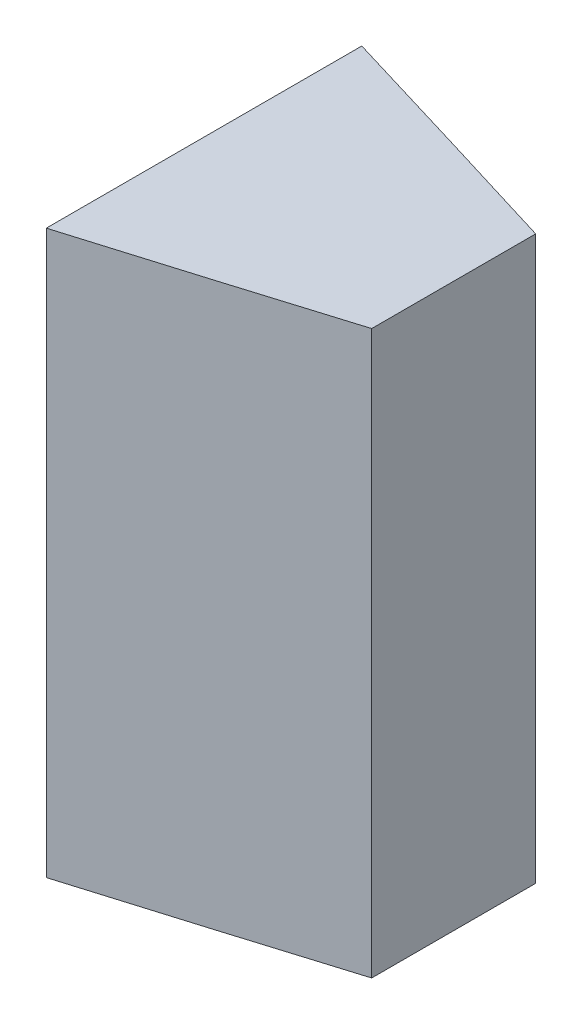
ISO-10303-21;
HEADER;
FILE_DESCRIPTION(('STEP AP214'),'2;1');
FILE_NAME('part.step','',(''),(''),'','','');
FILE_SCHEMA(('AUTOMOTIVE_DESIGN { 1 0 10303 214 1 1 1 1 }'));
ENDSEC;
DATA;
#1=APPLICATION_CONTEXT('core data for automotive mechanical design processes');
#2=APPLICATION_PROTOCOL_DEFINITION('international standard','automotive_design',2000,#1);
#3=PRODUCT_CONTEXT('',#1,'mechanical');
#4=PRODUCT('Part','Part','',(#3));
#5=PRODUCT_RELATED_PRODUCT_CATEGORY('part','',(#4));
#6=PRODUCT_DEFINITION_FORMATION('','',#4);
#7=PRODUCT_DEFINITION_CONTEXT('part definition',#1,'design');
#8=PRODUCT_DEFINITION('design','',#6,#7);
#9=PRODUCT_DEFINITION_SHAPE('','',#8);
#10=(LENGTH_UNIT() NAMED_UNIT(*) SI_UNIT(.MILLI.,.METRE.));
#11=(NAMED_UNIT(*) PLANE_ANGLE_UNIT() SI_UNIT($,.RADIAN.));
#12=(NAMED_UNIT(*) SI_UNIT($,.STERADIAN.) SOLID_ANGLE_UNIT());
#13=UNCERTAINTY_MEASURE_WITH_UNIT(LENGTH_MEASURE(1.E-05),#10,'distance_accuracy_value','');
#14=(GEOMETRIC_REPRESENTATION_CONTEXT(3) GLOBAL_UNCERTAINTY_ASSIGNED_CONTEXT((#13)) GLOBAL_UNIT_ASSIGNED_CONTEXT((#10,
#11,#12)) REPRESENTATION_CONTEXT('',''));
#15=CARTESIAN_POINT('',(0.,0.,0.));
#16=DIRECTION('',(0.,0.,1.));
#17=DIRECTION('',(1.,0.,0.));
#18=AXIS2_PLACEMENT_3D('',#15,#16,#17);
#19=CARTESIAN_POINT('',(35.0699557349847,9.10399609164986,-10.2042152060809));
#20=CARTESIAN_POINT('',(24.7263871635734,9.10399609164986,-13.389122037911));
#21=CARTESIAN_POINT('',(14.3682158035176,9.10399609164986,-16.5264355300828));
#22=CARTESIAN_POINT('',(4.00000000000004,9.10399609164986,-19.6301586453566));
#23=B_SPLINE_CURVE_WITH_KNOTS('',3,(#19,#20,#21,#22),.UNSPECIFIED.,.F.,.F.,(4,4),(0.,1.),.UNSPECIFIED.);
#24=DIRECTION('',(0.,1.,0.));
#25=VECTOR('',#24,1.);
#26=SURFACE_OF_LINEAR_EXTRUSION('',#23,#25);
#27=CARTESIAN_POINT('',(4.00000000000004,79.1039960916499,-19.6301586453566));
#28=CARTESIAN_POINT('',(14.3682158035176,79.1039960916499,-16.5264355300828));
#29=CARTESIAN_POINT('',(24.7263871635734,79.1039960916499,-13.389122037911));
#30=CARTESIAN_POINT('',(35.0699557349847,79.1039960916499,-10.2042152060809));
#31=B_SPLINE_CURVE_WITH_KNOTS('',3,(#27,#28,#29,#30),.UNSPECIFIED.,.F.,.F.,(4,4),(0.,1.),.UNSPECIFIED.);
#32=CARTESIAN_POINT('',(35.0699557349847,79.1039960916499,-10.2042152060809));
#33=VERTEX_POINT('',#32);
#34=CARTESIAN_POINT('',(4.00000000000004,79.1039960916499,-19.6301586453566));
#35=VERTEX_POINT('',#34);
#36=EDGE_CURVE('E146',#33,#35,#31,.F.);
#37=ORIENTED_EDGE('',*,*,#36,.F.);
#38=DIRECTION('',(0.,1.,0.));
#39=VECTOR('',#38,1.);
#40=CARTESIAN_POINT('',(35.0699557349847,9.10399609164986,-10.2042152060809));
#41=LINE('',#40,#39);
#42=CARTESIAN_POINT('',(35.0699557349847,9.10399609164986,-10.2042152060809));
#43=VERTEX_POINT('',#42);
#44=EDGE_CURVE('E11',#43,#33,#41,.T.);
#45=ORIENTED_EDGE('',*,*,#44,.F.);
#46=CARTESIAN_POINT('',(35.0699557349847,9.10399609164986,-10.2042152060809));
#47=CARTESIAN_POINT('',(24.7263871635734,9.10399609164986,-13.389122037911));
#48=CARTESIAN_POINT('',(14.3682158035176,9.10399609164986,-16.5264355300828));
#49=CARTESIAN_POINT('',(4.00000000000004,9.10399609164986,-19.6301586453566));
#50=B_SPLINE_CURVE_WITH_KNOTS('',3,(#46,#47,#48,#49),.UNSPECIFIED.,.F.,.F.,(4,4),(0.,1.),.UNSPECIFIED.);
#51=CARTESIAN_POINT('',(4.00000000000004,9.10399609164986,-19.6301586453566));
#52=VERTEX_POINT('',#51);
#53=EDGE_CURVE('E100',#43,#52,#50,.T.);
#54=ORIENTED_EDGE('',*,*,#53,.T.);
#55=DIRECTION('',(0.,1.,0.));
#56=VECTOR('',#55,1.);
#57=CARTESIAN_POINT('',(4.00000000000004,9.10399609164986,-19.6301586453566));
#58=LINE('',#57,#56);
#59=EDGE_CURVE('E79',#52,#35,#58,.T.);
#60=ORIENTED_EDGE('',*,*,#59,.T.);
#61=EDGE_LOOP('',(#37,#45,#54,#60));
#62=FACE_BOUND('',#61,.T.);
#63=ADVANCED_FACE('F33',(#62),#26,.T.);
#64=CARTESIAN_POINT('',(35.0699557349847,9.10399609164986,10.2042152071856));
#65=DIRECTION('',(1.,0.,0.));
#66=DIRECTION('',(0.,0.,-1.));
#67=AXIS2_PLACEMENT_3D('',#64,#65,#66);
#68=PLANE('',#67);
#69=DIRECTION('',(0.,0.,-1.));
#70=VECTOR('',#69,1.);
#71=CARTESIAN_POINT('',(35.0699557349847,79.1039960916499,10.2042152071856));
#72=LINE('',#71,#70);
#73=CARTESIAN_POINT('',(35.0699557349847,79.1039960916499,10.2042152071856));
#74=VERTEX_POINT('',#73);
#75=EDGE_CURVE('E102',#74,#33,#72,.T.);
#76=ORIENTED_EDGE('',*,*,#75,.F.);
#77=DIRECTION('',(0.,1.,0.));
#78=VECTOR('',#77,1.);
#79=CARTESIAN_POINT('',(35.0699557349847,9.10399609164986,10.2042152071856));
#80=LINE('',#79,#78);
#81=CARTESIAN_POINT('',(35.0699557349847,9.10399609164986,10.2042152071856));
#82=VERTEX_POINT('',#81);
#83=EDGE_CURVE('E45',#82,#74,#80,.T.);
#84=ORIENTED_EDGE('',*,*,#83,.F.);
#85=DIRECTION('',(0.,0.,-1.));
#86=VECTOR('',#85,1.);
#87=CARTESIAN_POINT('',(35.0699557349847,9.10399609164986,10.2042152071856));
#88=LINE('',#87,#86);
#89=EDGE_CURVE('E96',#82,#43,#88,.T.);
#90=ORIENTED_EDGE('',*,*,#89,.T.);
#91=ORIENTED_EDGE('',*,*,#44,.T.);
#92=EDGE_LOOP('',(#76,#84,#90,#91));
#93=FACE_BOUND('',#92,.T.);
#94=ADVANCED_FACE('F132',(#93),#68,.T.);
#95=CARTESIAN_POINT('',(4.00000000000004,9.10399609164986,19.630158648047));
#96=CARTESIAN_POINT('',(14.368216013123,9.10399609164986,16.5264354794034));
#97=CARTESIAN_POINT('',(24.7263869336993,9.10399609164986,13.3891221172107));
#98=CARTESIAN_POINT('',(35.0699557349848,9.10399609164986,10.2042152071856));
#99=B_SPLINE_CURVE_WITH_KNOTS('',3,(#95,#96,#97,#98),.UNSPECIFIED.,.F.,.F.,(4,4),(0.,1.),.UNSPECIFIED.);
#100=DIRECTION('',(0.,1.,0.));
#101=VECTOR('',#100,1.);
#102=SURFACE_OF_LINEAR_EXTRUSION('',#99,#101);
#103=CARTESIAN_POINT('',(35.0699557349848,79.1039960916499,10.2042152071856));
#104=CARTESIAN_POINT('',(24.7263869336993,79.1039960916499,13.3891221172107));
#105=CARTESIAN_POINT('',(14.368216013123,79.1039960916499,16.5264354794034));
#106=CARTESIAN_POINT('',(4.00000000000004,79.1039960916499,19.630158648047));
#107=B_SPLINE_CURVE_WITH_KNOTS('',3,(#103,#104,#105,#106),.UNSPECIFIED.,.F.,.F.,(4,4),(0.,1.),.UNSPECIFIED.);
#108=CARTESIAN_POINT('',(4.00000000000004,79.1039960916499,19.630158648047));
#109=VERTEX_POINT('',#108);
#110=EDGE_CURVE('E88',#109,#74,#107,.F.);
#111=ORIENTED_EDGE('',*,*,#110,.F.);
#112=DIRECTION('',(0.,1.,0.));
#113=VECTOR('',#112,1.);
#114=CARTESIAN_POINT('',(4.00000000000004,9.10399609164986,19.630158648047));
#115=LINE('',#114,#113);
#116=CARTESIAN_POINT('',(4.00000000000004,9.10399609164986,19.630158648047));
#117=VERTEX_POINT('',#116);
#118=EDGE_CURVE('E82',#117,#109,#115,.T.);
#119=ORIENTED_EDGE('',*,*,#118,.F.);
#120=CARTESIAN_POINT('',(4.00000000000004,9.10399609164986,19.630158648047));
#121=CARTESIAN_POINT('',(14.368216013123,9.10399609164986,16.5264354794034));
#122=CARTESIAN_POINT('',(24.7263869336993,9.10399609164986,13.3891221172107));
#123=CARTESIAN_POINT('',(35.0699557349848,9.10399609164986,10.2042152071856));
#124=B_SPLINE_CURVE_WITH_KNOTS('',3,(#120,#121,#122,#123),.UNSPECIFIED.,.F.,.F.,(4,4),(0.,1.),.UNSPECIFIED.);
#125=EDGE_CURVE('E85',#117,#82,#124,.T.);
#126=ORIENTED_EDGE('',*,*,#125,.T.);
#127=ORIENTED_EDGE('',*,*,#83,.T.);
#128=EDGE_LOOP('',(#111,#119,#126,#127));
#129=FACE_BOUND('',#128,.T.);
#130=ADVANCED_FACE('F84',(#129),#102,.T.);
#131=CARTESIAN_POINT('',(4.00000000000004,9.10399609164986,-19.6301586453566));
#132=DIRECTION('',(-1.,0.,0.));
#133=DIRECTION('',(0.,0.,1.));
#134=AXIS2_PLACEMENT_3D('',#131,#132,#133);
#135=PLANE('',#134);
#136=DIRECTION('',(0.,0.,1.));
#137=VECTOR('',#136,1.);
#138=CARTESIAN_POINT('',(4.00000000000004,79.1039960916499,-19.6301586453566));
#139=LINE('',#138,#137);
#140=EDGE_CURVE('E147',#35,#109,#139,.T.);
#141=ORIENTED_EDGE('',*,*,#140,.F.);
#142=ORIENTED_EDGE('',*,*,#59,.F.);
#143=DIRECTION('',(0.,0.,1.));
#144=VECTOR('',#143,1.);
#145=CARTESIAN_POINT('',(4.00000000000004,9.10399609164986,-19.6301586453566));
#146=LINE('',#145,#144);
#147=EDGE_CURVE('E95',#52,#117,#146,.T.);
#148=ORIENTED_EDGE('',*,*,#147,.T.);
#149=ORIENTED_EDGE('',*,*,#118,.T.);
#150=EDGE_LOOP('',(#141,#142,#148,#149));
#151=FACE_BOUND('',#150,.T.);
#152=ADVANCED_FACE('F99',(#151),#135,.T.);
#153=CARTESIAN_POINT('',(19.5442205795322,9.10399609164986,-14.9476308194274));
#154=DIRECTION('',(0.,-1.,0.));
#155=DIRECTION('',(0.,0.,-1.));
#156=AXIS2_PLACEMENT_3D('',#153,#154,#155);
#157=PLANE('',#156);
#158=ORIENTED_EDGE('',*,*,#53,.F.);
#159=ORIENTED_EDGE('',*,*,#89,.F.);
#160=ORIENTED_EDGE('',*,*,#125,.F.);
#161=ORIENTED_EDGE('',*,*,#147,.F.);
#162=EDGE_LOOP('',(#158,#159,#160,#161));
#163=FACE_BOUND('',#162,.T.);
#164=ADVANCED_FACE('F94',(#163),#157,.T.);
#165=CARTESIAN_POINT('',(19.5442205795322,79.1039960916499,-14.9476308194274));
#166=DIRECTION('',(0.,-1.,0.));
#167=DIRECTION('',(0.,0.,-1.));
#168=AXIS2_PLACEMENT_3D('',#165,#166,#167);
#169=PLANE('',#168);
#170=ORIENTED_EDGE('',*,*,#36,.T.);
#171=ORIENTED_EDGE('',*,*,#140,.T.);
#172=ORIENTED_EDGE('',*,*,#110,.T.);
#173=ORIENTED_EDGE('',*,*,#75,.T.);
#174=EDGE_LOOP('',(#170,#171,#172,#173));
#175=FACE_BOUND('',#174,.T.);
#176=ADVANCED_FACE('F121',(#175),#169,.F.);
#177=CLOSED_SHELL('',(#63,#94,#130,#152,#164,#176));
#178=MANIFOLD_SOLID_BREP('B2',#177);
#179=ADVANCED_BREP_SHAPE_REPRESENTATION('',(#18,#178),#14);
#180=SHAPE_DEFINITION_REPRESENTATION(#9,#179);
ENDSEC;
END-ISO-10303-21;
